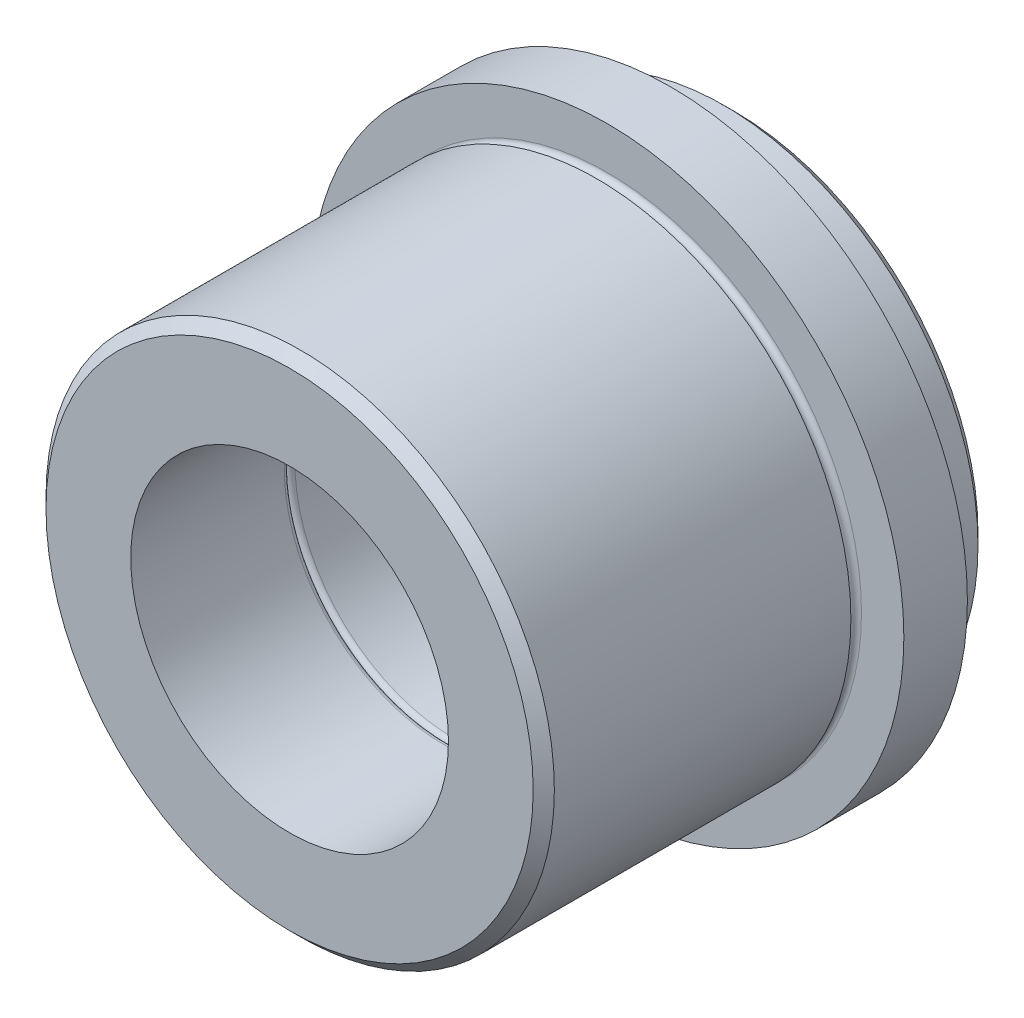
ISO-10303-21;
HEADER;
FILE_DESCRIPTION(('STEP AP214'),'2;1');
FILE_NAME('part.step','',(''),(''),'','','');
FILE_SCHEMA(('AUTOMOTIVE_DESIGN { 1 0 10303 214 1 1 1 1 }'));
ENDSEC;
DATA;
#1=APPLICATION_CONTEXT('core data for automotive mechanical design processes');
#2=APPLICATION_PROTOCOL_DEFINITION('international standard','automotive_design',2000,#1);
#3=PRODUCT_CONTEXT('',#1,'mechanical');
#4=PRODUCT('Part','Part','',(#3));
#5=PRODUCT_RELATED_PRODUCT_CATEGORY('part','',(#4));
#6=PRODUCT_DEFINITION_FORMATION('','',#4);
#7=PRODUCT_DEFINITION_CONTEXT('part definition',#1,'design');
#8=PRODUCT_DEFINITION('design','',#6,#7);
#9=PRODUCT_DEFINITION_SHAPE('','',#8);
#10=(LENGTH_UNIT() NAMED_UNIT(*) SI_UNIT(.MILLI.,.METRE.));
#11=(NAMED_UNIT(*) PLANE_ANGLE_UNIT() SI_UNIT($,.RADIAN.));
#12=(NAMED_UNIT(*) SI_UNIT($,.STERADIAN.) SOLID_ANGLE_UNIT());
#13=UNCERTAINTY_MEASURE_WITH_UNIT(LENGTH_MEASURE(1.E-05),#10,'distance_accuracy_value','');
#14=(GEOMETRIC_REPRESENTATION_CONTEXT(3) GLOBAL_UNCERTAINTY_ASSIGNED_CONTEXT((#13)) GLOBAL_UNIT_ASSIGNED_CONTEXT((#10,
#11,#12)) REPRESENTATION_CONTEXT('',''));
#15=CARTESIAN_POINT('',(0.,0.,0.));
#16=DIRECTION('',(0.,0.,1.));
#17=DIRECTION('',(1.,0.,0.));
#18=AXIS2_PLACEMENT_3D('',#15,#16,#17);
#19=CARTESIAN_POINT('',(0.,0.,0.));
#20=DIRECTION('',(0.,0.,1.));
#21=DIRECTION('',(1.,0.,0.));
#22=AXIS2_PLACEMENT_3D('',#19,#20,#21);
#23=CYLINDRICAL_SURFACE('',#22,15.);
#24=CARTESIAN_POINT('',(0.,0.,-14.5));
#25=DIRECTION('',(0.,0.,1.));
#26=DIRECTION('',(1.,0.,0.));
#27=AXIS2_PLACEMENT_3D('',#24,#25,#26);
#28=CIRCLE('',#27,15.);
#29=CARTESIAN_POINT('',(15.,0.,-14.5));
#30=VERTEX_POINT('',#29);
#31=EDGE_CURVE('E69',#30,#30,#28,.T.);
#32=ORIENTED_EDGE('',*,*,#31,.F.);
#33=EDGE_LOOP('',(#32));
#34=FACE_BOUND('',#33,.T.);
#35=CARTESIAN_POINT('',(0.,0.,0.));
#36=DIRECTION('',(0.,0.,1.));
#37=DIRECTION('',(1.,0.,0.));
#38=AXIS2_PLACEMENT_3D('',#35,#36,#37);
#39=CIRCLE('',#38,15.);
#40=CARTESIAN_POINT('',(15.,0.,0.));
#41=VERTEX_POINT('',#40);
#42=EDGE_CURVE('E33',#41,#41,#39,.T.);
#43=ORIENTED_EDGE('',*,*,#42,.T.);
#44=EDGE_LOOP('',(#43));
#45=FACE_BOUND('',#44,.T.);
#46=ADVANCED_FACE('F13',(#34,#45),#23,.F.);
#47=CARTESIAN_POINT('',(0.,15.,0.));
#48=DIRECTION('',(0.,0.,-1.));
#49=DIRECTION('',(-1.,0.,0.));
#50=AXIS2_PLACEMENT_3D('',#47,#48,#49);
#51=PLANE('',#50);
#52=CARTESIAN_POINT('',(0.,0.,0.));
#53=DIRECTION('',(0.,0.,-1.));
#54=DIRECTION('',(-1.,0.,0.));
#55=AXIS2_PLACEMENT_3D('',#52,#53,#54);
#56=CIRCLE('',#55,23.);
#57=CARTESIAN_POINT('',(-23.,0.,0.));
#58=VERTEX_POINT('',#57);
#59=EDGE_CURVE('E20',#58,#58,#56,.F.);
#60=ORIENTED_EDGE('',*,*,#59,.T.);
#61=EDGE_LOOP('',(#60));
#62=FACE_BOUND('',#61,.T.);
#63=ORIENTED_EDGE('',*,*,#42,.F.);
#64=EDGE_LOOP('',(#63));
#65=FACE_BOUND('',#64,.T.);
#66=ADVANCED_FACE('F77',(#62,#65),#51,.F.);
#67=CARTESIAN_POINT('',(0.,0.,0.));
#68=DIRECTION('',(0.,0.,1.));
#69=DIRECTION('',(1.,0.,0.));
#70=AXIS2_PLACEMENT_3D('',#67,#68,#69);
#71=CYLINDRICAL_SURFACE('',#70,24.);
#72=CARTESIAN_POINT('',(0.,0.,-1.));
#73=DIRECTION('',(0.,0.,-1.));
#74=DIRECTION('',(-1.,0.,0.));
#75=AXIS2_PLACEMENT_3D('',#72,#73,#74);
#76=CIRCLE('',#75,24.);
#77=CARTESIAN_POINT('',(-24.,0.,-1.));
#78=VERTEX_POINT('',#77);
#79=EDGE_CURVE('E8',#78,#78,#76,.T.);
#80=ORIENTED_EDGE('',*,*,#79,.T.);
#81=EDGE_LOOP('',(#80));
#82=FACE_BOUND('',#81,.T.);
#83=CARTESIAN_POINT('',(0.,0.,-29.));
#84=DIRECTION('',(0.,0.,1.));
#85=DIRECTION('',(1.,0.,0.));
#86=AXIS2_PLACEMENT_3D('',#83,#84,#85);
#87=CIRCLE('',#86,24.);
#88=CARTESIAN_POINT('',(24.,0.,-29.));
#89=VERTEX_POINT('',#88);
#90=EDGE_CURVE('E36',#89,#89,#87,.T.);
#91=ORIENTED_EDGE('',*,*,#90,.T.);
#92=EDGE_LOOP('',(#91));
#93=FACE_BOUND('',#92,.T.);
#94=ADVANCED_FACE('F82',(#82,#93),#71,.T.);
#95=CARTESIAN_POINT('',(0.,0.,-29.5));
#96=DIRECTION('',(0.,0.,1.));
#97=DIRECTION('',(1.,0.,0.));
#98=AXIS2_PLACEMENT_3D('',#95,#96,#97);
#99=TOROIDAL_SURFACE('',#98,24.,0.5);
#100=ORIENTED_EDGE('',*,*,#90,.F.);
#101=EDGE_LOOP('',(#100));
#102=FACE_BOUND('',#101,.T.);
#103=CARTESIAN_POINT('',(0.,0.,-30.));
#104=DIRECTION('',(0.,0.,1.));
#105=DIRECTION('',(1.,0.,0.));
#106=AXIS2_PLACEMENT_3D('',#103,#104,#105);
#107=CIRCLE('',#106,24.);
#108=CARTESIAN_POINT('',(24.,0.,-30.));
#109=VERTEX_POINT('',#108);
#110=EDGE_CURVE('E39',#109,#109,#107,.T.);
#111=ORIENTED_EDGE('',*,*,#110,.T.);
#112=EDGE_LOOP('',(#111));
#113=FACE_BOUND('',#112,.T.);
#114=ADVANCED_FACE('F89',(#102,#113),#99,.F.);
#115=CARTESIAN_POINT('',(0.,24.,-30.));
#116=DIRECTION('',(0.,0.,-1.));
#117=DIRECTION('',(-1.,0.,0.));
#118=AXIS2_PLACEMENT_3D('',#115,#116,#117);
#119=PLANE('',#118);
#120=ORIENTED_EDGE('',*,*,#110,.F.);
#121=EDGE_LOOP('',(#120));
#122=FACE_BOUND('',#121,.T.);
#123=CARTESIAN_POINT('',(0.,0.,-30.));
#124=DIRECTION('',(0.,0.,1.));
#125=DIRECTION('',(1.,0.,0.));
#126=AXIS2_PLACEMENT_3D('',#123,#124,#125);
#127=CIRCLE('',#126,28.);
#128=CARTESIAN_POINT('',(28.,0.,-30.));
#129=VERTEX_POINT('',#128);
#130=EDGE_CURVE('E42',#129,#129,#127,.T.);
#131=ORIENTED_EDGE('',*,*,#130,.T.);
#132=EDGE_LOOP('',(#131));
#133=FACE_BOUND('',#132,.T.);
#134=ADVANCED_FACE('F124',(#122,#133),#119,.F.);
#135=CARTESIAN_POINT('',(0.,0.,0.));
#136=DIRECTION('',(0.,0.,1.));
#137=DIRECTION('',(1.,0.,0.));
#138=AXIS2_PLACEMENT_3D('',#135,#136,#137);
#139=CYLINDRICAL_SURFACE('',#138,28.);
#140=ORIENTED_EDGE('',*,*,#130,.F.);
#141=EDGE_LOOP('',(#140));
#142=FACE_BOUND('',#141,.T.);
#143=CARTESIAN_POINT('',(0.,0.,-36.));
#144=DIRECTION('',(0.,0.,1.));
#145=DIRECTION('',(1.,0.,0.));
#146=AXIS2_PLACEMENT_3D('',#143,#144,#145);
#147=CIRCLE('',#146,28.);
#148=CARTESIAN_POINT('',(28.,0.,-36.));
#149=VERTEX_POINT('',#148);
#150=EDGE_CURVE('E45',#149,#149,#147,.T.);
#151=ORIENTED_EDGE('',*,*,#150,.T.);
#152=EDGE_LOOP('',(#151));
#153=FACE_BOUND('',#152,.T.);
#154=ADVANCED_FACE('F117',(#142,#153),#139,.T.);
#155=CARTESIAN_POINT('',(0.,28.,-36.));
#156=DIRECTION('',(0.,0.,1.));
#157=DIRECTION('',(1.,0.,0.));
#158=AXIS2_PLACEMENT_3D('',#155,#156,#157);
#159=PLANE('',#158);
#160=ORIENTED_EDGE('',*,*,#150,.F.);
#161=EDGE_LOOP('',(#160));
#162=FACE_BOUND('',#161,.T.);
#163=CARTESIAN_POINT('',(0.,0.,-36.));
#164=DIRECTION('',(0.,0.,1.));
#165=DIRECTION('',(1.,0.,0.));
#166=AXIS2_PLACEMENT_3D('',#163,#164,#165);
#167=CIRCLE('',#166,24.);
#168=CARTESIAN_POINT('',(24.,0.,-36.));
#169=VERTEX_POINT('',#168);
#170=EDGE_CURVE('E48',#169,#169,#167,.T.);
#171=ORIENTED_EDGE('',*,*,#170,.T.);
#172=EDGE_LOOP('',(#171));
#173=FACE_BOUND('',#172,.T.);
#174=ADVANCED_FACE('F112',(#162,#173),#159,.F.);
#175=CARTESIAN_POINT('',(0.,0.,0.));
#176=DIRECTION('',(0.,0.,1.));
#177=DIRECTION('',(1.,0.,0.));
#178=AXIS2_PLACEMENT_3D('',#175,#176,#177);
#179=CYLINDRICAL_SURFACE('',#178,24.);
#180=CARTESIAN_POINT('',(0.,0.,-41.));
#181=DIRECTION('',(0.,0.,1.));
#182=DIRECTION('',(1.,0.,0.));
#183=AXIS2_PLACEMENT_3D('',#180,#181,#182);
#184=CIRCLE('',#183,24.);
#185=CARTESIAN_POINT('',(24.,0.,-41.));
#186=VERTEX_POINT('',#185);
#187=EDGE_CURVE('E28',#186,#186,#184,.T.);
#188=ORIENTED_EDGE('',*,*,#187,.T.);
#189=EDGE_LOOP('',(#188));
#190=FACE_BOUND('',#189,.T.);
#191=ORIENTED_EDGE('',*,*,#170,.F.);
#192=EDGE_LOOP('',(#191));
#193=FACE_BOUND('',#192,.T.);
#194=ADVANCED_FACE('F108',(#190,#193),#179,.T.);
#195=CARTESIAN_POINT('',(0.,24.,-42.));
#196=DIRECTION('',(0.,0.,1.));
#197=DIRECTION('',(1.,0.,0.));
#198=AXIS2_PLACEMENT_3D('',#195,#196,#197);
#199=PLANE('',#198);
#200=CARTESIAN_POINT('',(0.,0.,-42.));
#201=DIRECTION('',(0.,0.,1.));
#202=DIRECTION('',(1.,0.,0.));
#203=AXIS2_PLACEMENT_3D('',#200,#201,#202);
#204=CIRCLE('',#203,23.);
#205=CARTESIAN_POINT('',(23.,0.,-42.));
#206=VERTEX_POINT('',#205);
#207=EDGE_CURVE('E24',#206,#206,#204,.F.);
#208=ORIENTED_EDGE('',*,*,#207,.T.);
#209=EDGE_LOOP('',(#208));
#210=FACE_BOUND('',#209,.T.);
#211=CARTESIAN_POINT('',(0.,0.,-42.));
#212=DIRECTION('',(0.,0.,1.));
#213=DIRECTION('',(1.,0.,0.));
#214=AXIS2_PLACEMENT_3D('',#211,#212,#213);
#215=CIRCLE('',#214,15.);
#216=CARTESIAN_POINT('',(15.,0.,-42.));
#217=VERTEX_POINT('',#216);
#218=EDGE_CURVE('E51',#217,#217,#215,.T.);
#219=ORIENTED_EDGE('',*,*,#218,.T.);
#220=EDGE_LOOP('',(#219));
#221=FACE_BOUND('',#220,.T.);
#222=ADVANCED_FACE('F111',(#210,#221),#199,.F.);
#223=CARTESIAN_POINT('',(0.,0.,0.));
#224=DIRECTION('',(0.,0.,1.));
#225=DIRECTION('',(1.,0.,0.));
#226=AXIS2_PLACEMENT_3D('',#223,#224,#225);
#227=CYLINDRICAL_SURFACE('',#226,15.);
#228=ORIENTED_EDGE('',*,*,#218,.F.);
#229=EDGE_LOOP('',(#228));
#230=FACE_BOUND('',#229,.T.);
#231=CARTESIAN_POINT('',(0.,0.,-31.5));
#232=DIRECTION('',(0.,0.,1.));
#233=DIRECTION('',(1.,0.,0.));
#234=AXIS2_PLACEMENT_3D('',#231,#232,#233);
#235=CIRCLE('',#234,15.);
#236=CARTESIAN_POINT('',(15.,0.,-31.5));
#237=VERTEX_POINT('',#236);
#238=EDGE_CURVE('E54',#237,#237,#235,.T.);
#239=ORIENTED_EDGE('',*,*,#238,.T.);
#240=EDGE_LOOP('',(#239));
#241=FACE_BOUND('',#240,.T.);
#242=ADVANCED_FACE('F240',(#230,#241),#227,.F.);
#243=CARTESIAN_POINT('',(0.,0.,-31.5));
#244=DIRECTION('',(0.,0.,1.));
#245=DIRECTION('',(1.,0.,0.));
#246=AXIS2_PLACEMENT_3D('',#243,#244,#245);
#247=TOROIDAL_SURFACE('',#246,15.5,0.5);
#248=ORIENTED_EDGE('',*,*,#238,.F.);
#249=EDGE_LOOP('',(#248));
#250=FACE_BOUND('',#249,.T.);
#251=CARTESIAN_POINT('',(0.,0.,-31.));
#252=DIRECTION('',(0.,0.,1.));
#253=DIRECTION('',(1.,0.,0.));
#254=AXIS2_PLACEMENT_3D('',#251,#252,#253);
#255=CIRCLE('',#254,15.5);
#256=CARTESIAN_POINT('',(15.5,0.,-31.));
#257=VERTEX_POINT('',#256);
#258=EDGE_CURVE('E57',#257,#257,#255,.T.);
#259=ORIENTED_EDGE('',*,*,#258,.T.);
#260=EDGE_LOOP('',(#259));
#261=FACE_BOUND('',#260,.T.);
#262=ADVANCED_FACE('F231',(#250,#261),#247,.T.);
#263=CARTESIAN_POINT('',(0.,0.,-30.5));
#264=DIRECTION('',(0.,0.,1.));
#265=DIRECTION('',(1.,0.,0.));
#266=AXIS2_PLACEMENT_3D('',#263,#264,#265);
#267=TOROIDAL_SURFACE('',#266,15.5,0.5);
#268=ORIENTED_EDGE('',*,*,#258,.F.);
#269=EDGE_LOOP('',(#268));
#270=FACE_BOUND('',#269,.T.);
#271=CARTESIAN_POINT('',(0.,0.,-30.5));
#272=DIRECTION('',(0.,0.,1.));
#273=DIRECTION('',(1.,0.,0.));
#274=AXIS2_PLACEMENT_3D('',#271,#272,#273);
#275=CIRCLE('',#274,15.);
#276=CARTESIAN_POINT('',(15.,0.,-30.5));
#277=VERTEX_POINT('',#276);
#278=EDGE_CURVE('E60',#277,#277,#275,.T.);
#279=ORIENTED_EDGE('',*,*,#278,.T.);
#280=EDGE_LOOP('',(#279));
#281=FACE_BOUND('',#280,.T.);
#282=ADVANCED_FACE('F222',(#270,#281),#267,.T.);
#283=CARTESIAN_POINT('',(0.,0.,0.));
#284=DIRECTION('',(0.,0.,1.));
#285=DIRECTION('',(1.,0.,0.));
#286=AXIS2_PLACEMENT_3D('',#283,#284,#285);
#287=CYLINDRICAL_SURFACE('',#286,15.);
#288=ORIENTED_EDGE('',*,*,#278,.F.);
#289=EDGE_LOOP('',(#288));
#290=FACE_BOUND('',#289,.T.);
#291=CARTESIAN_POINT('',(0.,0.,-15.5));
#292=DIRECTION('',(0.,0.,1.));
#293=DIRECTION('',(1.,0.,0.));
#294=AXIS2_PLACEMENT_3D('',#291,#292,#293);
#295=CIRCLE('',#294,15.);
#296=CARTESIAN_POINT('',(15.,0.,-15.5));
#297=VERTEX_POINT('',#296);
#298=EDGE_CURVE('E63',#297,#297,#295,.T.);
#299=ORIENTED_EDGE('',*,*,#298,.T.);
#300=EDGE_LOOP('',(#299));
#301=FACE_BOUND('',#300,.T.);
#302=ADVANCED_FACE('F214',(#290,#301),#287,.F.);
#303=CARTESIAN_POINT('',(0.,0.,-15.5));
#304=DIRECTION('',(0.,0.,1.));
#305=DIRECTION('',(1.,0.,0.));
#306=AXIS2_PLACEMENT_3D('',#303,#304,#305);
#307=TOROIDAL_SURFACE('',#306,15.5,0.5);
#308=ORIENTED_EDGE('',*,*,#298,.F.);
#309=EDGE_LOOP('',(#308));
#310=FACE_BOUND('',#309,.T.);
#311=CARTESIAN_POINT('',(0.,0.,-15.));
#312=DIRECTION('',(0.,0.,1.));
#313=DIRECTION('',(1.,0.,0.));
#314=AXIS2_PLACEMENT_3D('',#311,#312,#313);
#315=CIRCLE('',#314,15.5);
#316=CARTESIAN_POINT('',(15.5,0.,-15.));
#317=VERTEX_POINT('',#316);
#318=EDGE_CURVE('E66',#317,#317,#315,.T.);
#319=ORIENTED_EDGE('',*,*,#318,.T.);
#320=EDGE_LOOP('',(#319));
#321=FACE_BOUND('',#320,.T.);
#322=ADVANCED_FACE('F101',(#310,#321),#307,.T.);
#323=CARTESIAN_POINT('',(0.,0.,-14.5));
#324=DIRECTION('',(0.,0.,1.));
#325=DIRECTION('',(1.,0.,0.));
#326=AXIS2_PLACEMENT_3D('',#323,#324,#325);
#327=TOROIDAL_SURFACE('',#326,15.5,0.5);
#328=ORIENTED_EDGE('',*,*,#318,.F.);
#329=EDGE_LOOP('',(#328));
#330=FACE_BOUND('',#329,.T.);
#331=ORIENTED_EDGE('',*,*,#31,.T.);
#332=EDGE_LOOP('',(#331));
#333=FACE_BOUND('',#332,.T.);
#334=ADVANCED_FACE('F73',(#330,#333),#327,.T.);
#335=CARTESIAN_POINT('',(0.,0.,-41.));
#336=DIRECTION('',(0.,0.,1.));
#337=DIRECTION('',(1.,0.,0.));
#338=AXIS2_PLACEMENT_3D('',#335,#336,#337);
#339=CONICAL_SURFACE('',#338,24.,0.785398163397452);
#340=ORIENTED_EDGE('',*,*,#207,.F.);
#341=EDGE_LOOP('',(#340));
#342=FACE_BOUND('',#341,.T.);
#343=ORIENTED_EDGE('',*,*,#187,.F.);
#344=EDGE_LOOP('',(#343));
#345=FACE_BOUND('',#344,.T.);
#346=ADVANCED_FACE('F92',(#342,#345),#339,.T.);
#347=CARTESIAN_POINT('',(0.,0.,0.));
#348=DIRECTION('',(0.,0.,-1.));
#349=DIRECTION('',(-1.,0.,0.));
#350=AXIS2_PLACEMENT_3D('',#347,#348,#349);
#351=CONICAL_SURFACE('',#350,23.,0.785398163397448);
#352=ORIENTED_EDGE('',*,*,#79,.F.);
#353=EDGE_LOOP('',(#352));
#354=FACE_BOUND('',#353,.T.);
#355=ORIENTED_EDGE('',*,*,#59,.F.);
#356=EDGE_LOOP('',(#355));
#357=FACE_BOUND('',#356,.T.);
#358=ADVANCED_FACE('F15',(#354,#357),#351,.T.);
#359=CLOSED_SHELL('',(#46,#66,#94,#114,#134,#154,#174,#194,#222,#242,#262,#282,#302,#322,#334,
#346,#358));
#360=MANIFOLD_SOLID_BREP('B1',#359);
#361=ADVANCED_BREP_SHAPE_REPRESENTATION('',(#18,#360),#14);
#362=SHAPE_DEFINITION_REPRESENTATION(#9,#361);
ENDSEC;
END-ISO-10303-21;
